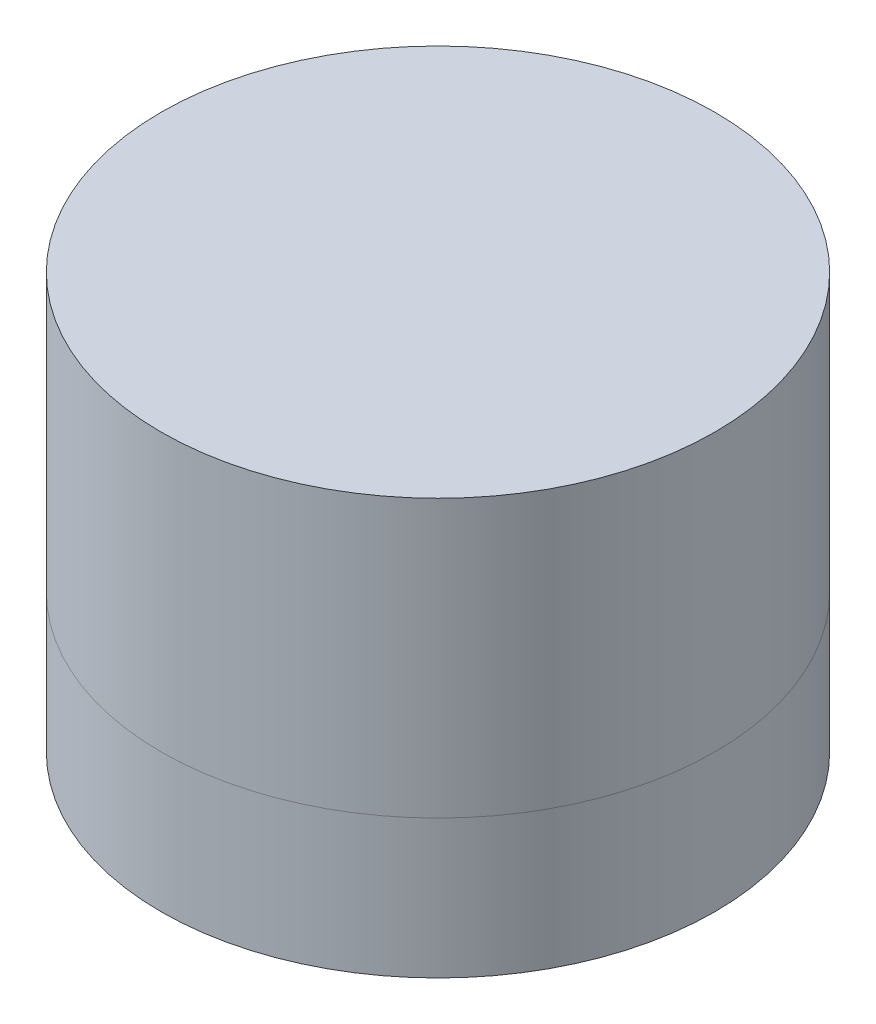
ISO-10303-21;
HEADER;
FILE_DESCRIPTION(('STEP AP214'),'2;1');
FILE_NAME('part.step','',(''),(''),'','','');
FILE_SCHEMA(('AUTOMOTIVE_DESIGN { 1 0 10303 214 1 1 1 1 }'));
ENDSEC;
DATA;
#1=APPLICATION_CONTEXT('core data for automotive mechanical design processes');
#2=APPLICATION_PROTOCOL_DEFINITION('international standard','automotive_design',2000,#1);
#3=PRODUCT_CONTEXT('',#1,'mechanical');
#4=PRODUCT('Part','Part','',(#3));
#5=PRODUCT_RELATED_PRODUCT_CATEGORY('part','',(#4));
#6=PRODUCT_DEFINITION_FORMATION('','',#4);
#7=PRODUCT_DEFINITION_CONTEXT('part definition',#1,'design');
#8=PRODUCT_DEFINITION('design','',#6,#7);
#9=PRODUCT_DEFINITION_SHAPE('','',#8);
#10=(LENGTH_UNIT() NAMED_UNIT(*) SI_UNIT(.MILLI.,.METRE.));
#11=(NAMED_UNIT(*) PLANE_ANGLE_UNIT() SI_UNIT($,.RADIAN.));
#12=(NAMED_UNIT(*) SI_UNIT($,.STERADIAN.) SOLID_ANGLE_UNIT());
#13=UNCERTAINTY_MEASURE_WITH_UNIT(LENGTH_MEASURE(1.E-05),#10,'distance_accuracy_value','');
#14=(GEOMETRIC_REPRESENTATION_CONTEXT(3) GLOBAL_UNCERTAINTY_ASSIGNED_CONTEXT((#13)) GLOBAL_UNIT_ASSIGNED_CONTEXT((#10,
#11,#12)) REPRESENTATION_CONTEXT('',''));
#15=CARTESIAN_POINT('',(0.,0.,0.));
#16=DIRECTION('',(0.,0.,1.));
#17=DIRECTION('',(1.,0.,0.));
#18=AXIS2_PLACEMENT_3D('',#15,#16,#17);
#19=CARTESIAN_POINT('',(4.8278025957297,-10.,0.));
#20=DIRECTION('',(0.,1.,0.));
#21=DIRECTION('',(0.,0.,1.));
#22=AXIS2_PLACEMENT_3D('',#19,#20,#21);
#23=PLANE('',#22);
#24=CARTESIAN_POINT('',(4.8278025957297,-10.,0.));
#25=DIRECTION('',(0.,1.,0.));
#26=DIRECTION('',(0.,0.,1.));
#27=AXIS2_PLACEMENT_3D('',#24,#25,#26);
#28=CIRCLE('',#27,20.);
#29=CARTESIAN_POINT('',(4.8278025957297,-10.,20.));
#30=VERTEX_POINT('',#29);
#31=EDGE_CURVE('E111',#30,#30,#28,.T.);
#32=ORIENTED_EDGE('',*,*,#31,.F.);
#33=EDGE_LOOP('',(#32));
#34=FACE_BOUND('',#33,.T.);
#35=ADVANCED_FACE('F74',(#34),#23,.F.);
#36=CARTESIAN_POINT('',(4.8278025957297,-10.,0.));
#37=DIRECTION('',(0.,1.,0.));
#38=DIRECTION('',(0.,0.,1.));
#39=AXIS2_PLACEMENT_3D('',#36,#37,#38);
#40=CYLINDRICAL_SURFACE('',#39,20.);
#41=ORIENTED_EDGE('',*,*,#31,.T.);
#42=EDGE_LOOP('',(#41));
#43=FACE_BOUND('',#42,.T.);
#44=CARTESIAN_POINT('',(4.8278025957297,0.,0.));
#45=DIRECTION('',(0.,1.,0.));
#46=DIRECTION('',(0.,0.,1.));
#47=AXIS2_PLACEMENT_3D('',#44,#45,#46);
#48=CIRCLE('',#47,20.);
#49=CARTESIAN_POINT('',(4.8278025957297,0.,20.));
#50=VERTEX_POINT('',#49);
#51=EDGE_CURVE('E78',#50,#50,#48,.F.);
#52=ORIENTED_EDGE('',*,*,#51,.T.);
#53=EDGE_LOOP('',(#52));
#54=FACE_BOUND('',#53,.T.);
#55=ADVANCED_FACE('F76',(#43,#54),#40,.T.);
#56=CARTESIAN_POINT('',(4.8278025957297,-0.450000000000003,0.));
#57=DIRECTION('',(0.,-1.,0.));
#58=DIRECTION('',(-1.,0.,0.));
#59=AXIS2_PLACEMENT_3D('',#56,#57,#58);
#60=SPHERICAL_SURFACE('',#59,10.58);
#61=CARTESIAN_POINT('',(4.8278025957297,3.,0.));
#62=DIRECTION('',(0.,-1.,0.));
#63=DIRECTION('',(0.,0.,-1.));
#64=AXIS2_PLACEMENT_3D('',#61,#62,#63);
#65=CIRCLE('',#64,10.0016948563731);
#66=CARTESIAN_POINT('',(4.8278025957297,3.,-10.0016948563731));
#67=VERTEX_POINT('',#66);
#68=EDGE_CURVE('E113',#67,#67,#65,.T.);
#69=ORIENTED_EDGE('',*,*,#68,.F.);
#70=EDGE_LOOP('',(#69));
#71=FACE_BOUND('',#70,.T.);
#72=ADVANCED_FACE('F107',(#71),#60,.T.);
#73=CARTESIAN_POINT('',(4.8278025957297,3.,0.));
#74=DIRECTION('',(0.,1.,0.));
#75=DIRECTION('',(0.,0.,1.));
#76=AXIS2_PLACEMENT_3D('',#73,#74,#75);
#77=CONICAL_SURFACE('',#76,10.0016948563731,0.000564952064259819);
#78=CARTESIAN_POINT('',(4.8278025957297,0.,0.));
#79=DIRECTION('',(0.,-1.,0.));
#80=DIRECTION('',(0.,0.,-1.));
#81=AXIS2_PLACEMENT_3D('',#78,#79,#80);
#82=CIRCLE('',#81,10.);
#83=CARTESIAN_POINT('',(4.8278025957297,0.,-10.));
#84=VERTEX_POINT('',#83);
#85=EDGE_CURVE('E83',#84,#84,#82,.T.);
#86=ORIENTED_EDGE('',*,*,#85,.F.);
#87=EDGE_LOOP('',(#86));
#88=FACE_BOUND('',#87,.T.);
#89=ORIENTED_EDGE('',*,*,#68,.T.);
#90=EDGE_LOOP('',(#89));
#91=FACE_BOUND('',#90,.T.);
#92=ADVANCED_FACE('F98',(#88,#91),#77,.T.);
#93=CARTESIAN_POINT('',(14.8278025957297,0.,0.));
#94=DIRECTION('',(0.,-1.,0.));
#95=DIRECTION('',(0.,0.,-1.));
#96=AXIS2_PLACEMENT_3D('',#93,#94,#95);
#97=PLANE('',#96);
#98=CARTESIAN_POINT('',(4.8278025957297,0.,-15.));
#99=CARTESIAN_POINT('',(5.07532465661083,0.,-15.0000190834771));
#100=CARTESIAN_POINT('',(5.32285951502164,0.,-14.9941059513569));
#101=CARTESIAN_POINT('',(5.81556402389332,0.,-14.9702985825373));
#102=CARTESIAN_POINT('',(6.06073787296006,0.,-14.9524909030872));
#103=CARTESIAN_POINT('',(6.54872354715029,0.,-14.9048990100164));
#104=CARTESIAN_POINT('',(6.79154106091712,0.,-14.8751733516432));
#105=CARTESIAN_POINT('',(7.27481111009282,0.,-14.8037804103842));
#106=CARTESIAN_POINT('',(7.51526796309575,0.,-14.7621423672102));
#107=CARTESIAN_POINT('',(7.99381910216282,0.,-14.6669527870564));
#108=CARTESIAN_POINT('',(8.23191332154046,0.,-14.6134009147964));
#109=CARTESIAN_POINT('',(8.70574394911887,0.,-14.4944140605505));
#110=CARTESIAN_POINT('',(8.94147298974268,0.,-14.4289497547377));
#111=CARTESIAN_POINT('',(9.41058131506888,0.,-14.286166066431));
#112=CARTESIAN_POINT('',(9.64394327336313,0.,-14.2087897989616));
#113=CARTESIAN_POINT('',(10.1083271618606,0.,-14.042212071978));
#114=CARTESIAN_POINT('',(10.3393195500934,0.,-13.9529283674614));
#115=CARTESIAN_POINT('',(10.7967237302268,0.,-13.7634844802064));
#116=CARTESIAN_POINT('',(11.0231368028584,0.,-13.6633273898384));
#117=CARTESIAN_POINT('',(11.4691967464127,0.,-13.4528238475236));
#118=CARTESIAN_POINT('',(11.6888805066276,0.,-13.3425556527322));
#119=CARTESIAN_POINT('',(12.121487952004,0.,-13.1118590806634));
#120=CARTESIAN_POINT('',(12.3344391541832,0.,-12.9914823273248));
#121=CARTESIAN_POINT('',(12.7535917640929,0.,-12.7405951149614));
#122=CARTESIAN_POINT('',(12.9598081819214,0.,-12.6101097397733));
#123=CARTESIAN_POINT('',(13.3655043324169,0.,-12.3390321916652));
#124=CARTESIAN_POINT('',(13.5649836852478,0.,-12.1984394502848));
#125=CARTESIAN_POINT('',(13.9572217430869,0.,-11.90717295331));
#126=CARTESIAN_POINT('',(14.1499622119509,0.,-11.7564746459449));
#127=CARTESIAN_POINT('',(14.5287406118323,0.,-11.4450198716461));
#128=CARTESIAN_POINT('',(14.7147405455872,0.,-11.2842172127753));
#129=CARTESIAN_POINT('',(15.0800586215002,0.,-10.9525778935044));
#130=CARTESIAN_POINT('',(15.2593177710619,0.,-10.7816763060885));
#131=CARTESIAN_POINT('',(15.6094238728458,0.,-10.4315941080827));
#132=CARTESIAN_POINT('',(15.7802740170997,0.,-10.2524166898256));
#133=CARTESIAN_POINT('',(16.1118235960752,0.,-9.88723717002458));
#134=CARTESIAN_POINT('',(16.2725870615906,0.,-9.70129325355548));
#135=CARTESIAN_POINT('',(16.5839804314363,0.,-9.32260567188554));
#136=CARTESIAN_POINT('',(16.7346555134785,0.,-9.12989917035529));
#137=CARTESIAN_POINT('',(17.0258916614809,0.,-8.73770686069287));
#138=CARTESIAN_POINT('',(17.1664761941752,0.,-8.53823848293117));
#139=CARTESIAN_POINT('',(17.4375536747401,0.,-8.13254228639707));
#140=CARTESIAN_POINT('',(17.5680460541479,0.,-7.92631408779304));
#141=CARTESIAN_POINT('',(17.8189639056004,0.,-7.50711592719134));
#142=CARTESIAN_POINT('',(17.9393631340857,0.,-7.29413026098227));
#143=CARTESIAN_POINT('',(18.1701201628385,0.,-6.86143135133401));
#144=CARTESIAN_POINT('',(18.2804251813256,0.,-6.64168997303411));
#145=CARTESIAN_POINT('',(18.4910222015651,0.,-6.19549401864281));
#146=CARTESIAN_POINT('',(18.5912348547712,0.,-5.96900203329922));
#147=CARTESIAN_POINT('',(18.7807200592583,0.,-5.51158845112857));
#148=CARTESIAN_POINT('',(18.869996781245,0.,-5.28066858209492));
#149=CARTESIAN_POINT('',(19.0365604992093,0.,-4.81640816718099));
#150=CARTESIAN_POINT('',(19.113928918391,0.,-4.58309687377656));
#151=CARTESIAN_POINT('',(19.2567014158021,0.,-4.11407008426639));
#152=CARTESIAN_POINT('',(19.3221614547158,0.,-3.87837163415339));
#153=CARTESIAN_POINT('',(19.4411430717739,0.,-3.40458193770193));
#154=CARTESIAN_POINT('',(19.4946930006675,0.,-3.16649781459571));
#155=CARTESIAN_POINT('',(19.589882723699,0.,-2.68794654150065));
#156=CARTESIAN_POINT('',(19.6315218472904,0.,-2.44747925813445));
#157=CARTESIAN_POINT('',(19.7029195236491,0.,-1.9641685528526));
#158=CARTESIAN_POINT('',(19.7326478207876,0.,-1.72132066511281));
#159=CARTESIAN_POINT('',(19.7802528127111,0.,-1.23325210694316));
#160=CARTESIAN_POINT('',(19.7980699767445,0.,-0.988025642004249));
#161=CARTESIAN_POINT('',(19.8218844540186,0.,-0.495202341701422));
#162=CARTESIAN_POINT('',(19.8277941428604,0.,-0.247601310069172));
#163=CARTESIAN_POINT('',(19.8278110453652,0.,0.247506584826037));
#164=CARTESIAN_POINT('',(19.8219227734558,0.,0.495013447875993));
#165=CARTESIAN_POINT('',(19.7981428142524,0.,0.98767531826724));
#166=CARTESIAN_POINT('',(19.7803375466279,0.,1.23283445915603));
#167=CARTESIAN_POINT('',(19.7327533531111,0.,1.72079537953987));
#168=CARTESIAN_POINT('',(19.7030326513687,0.,1.96360282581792));
#169=CARTESIAN_POINT('',(19.6316458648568,0.,2.44685972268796));
#170=CARTESIAN_POINT('',(19.5900086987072,0.,2.68731344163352));
#171=CARTESIAN_POINT('',(19.4948188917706,0.,3.16586469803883));
#172=CARTESIAN_POINT('',(19.4412655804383,0.,3.40396210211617));
#173=CARTESIAN_POINT('',(19.3222734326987,0.,3.87780567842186));
#174=CARTESIAN_POINT('',(19.2568049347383,0.,4.11354439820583));
#175=CARTESIAN_POINT('',(19.1140104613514,0.,4.58267859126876));
#176=CARTESIAN_POINT('',(19.0366272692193,0.,4.81605663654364));
#177=CARTESIAN_POINT('',(18.8700336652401,0.,5.28047940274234));
#178=CARTESIAN_POINT('',(18.7807406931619,0.,5.51149446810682));
#179=CARTESIAN_POINT('',(18.5912867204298,0.,5.96892098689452));
#180=CARTESIAN_POINT('',(18.4911298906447,0.,6.19533416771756));
#181=CARTESIAN_POINT('',(18.2806265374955,0.,6.64139418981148));
#182=CARTESIAN_POINT('',(18.1703582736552,0.,6.86107792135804));
#183=CARTESIAN_POINT('',(17.9396616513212,0.,7.29368534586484));
#184=CARTESIAN_POINT('',(17.8192849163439,0.,7.50663655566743));
#185=CARTESIAN_POINT('',(17.5683977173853,0.,7.92578917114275));
#186=CARTESIAN_POINT('',(17.4379123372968,0.,8.13200558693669));
#187=CARTESIAN_POINT('',(17.1668347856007,0.,8.53770173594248));
#188=CARTESIAN_POINT('',(17.026242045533,0.,8.7371810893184));
#189=CARTESIAN_POINT('',(16.7349755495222,0.,9.12941914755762));
#190=CARTESIAN_POINT('',(16.5842772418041,0.,9.32215961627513));
#191=CARTESIAN_POINT('',(16.2728224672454,0.,9.70093801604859));
#192=CARTESIAN_POINT('',(16.1120198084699,0.,9.88693794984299));
#193=CARTESIAN_POINT('',(15.7803804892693,0.,10.2522560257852));
#194=CARTESIAN_POINT('',(15.6094789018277,0.,10.4315151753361));
#195=CARTESIAN_POINT('',(15.2593967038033,0.,10.7816212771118));
#196=CARTESIAN_POINT('',(15.0802192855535,0.,10.9524714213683));
#197=CARTESIAN_POINT('',(14.7150397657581,0.,11.2840210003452));
#198=CARTESIAN_POINT('',(14.5290958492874,0.,11.4447844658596));
#199=CARTESIAN_POINT('',(14.1504082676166,0.,11.7561778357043));
#200=CARTESIAN_POINT('',(13.957701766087,0.,11.9068529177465));
#201=CARTESIAN_POINT('',(13.5655094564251,0.,12.1980890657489));
#202=CARTESIAN_POINT('',(13.3660410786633,0.,12.3386735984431));
#203=CARTESIAN_POINT('',(12.9603448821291,0.,12.609751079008));
#204=CARTESIAN_POINT('',(12.7541166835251,0.,12.7402434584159));
#205=CARTESIAN_POINT('',(12.3349185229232,0.,12.9911613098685));
#206=CARTESIAN_POINT('',(12.121932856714,0.,13.111560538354));
#207=CARTESIAN_POINT('',(11.6892339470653,0.,13.3423175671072));
#208=CARTESIAN_POINT('',(11.4694925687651,0.,13.4526225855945));
#209=CARTESIAN_POINT('',(11.0232966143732,0.,13.6632196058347));
#210=CARTESIAN_POINT('',(10.7968046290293,0.,13.7634322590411));
#211=CARTESIAN_POINT('',(10.3393910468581,0.,13.9529174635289));
#212=CARTESIAN_POINT('',(10.1084711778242,0.,14.0421941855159));
#213=CARTESIAN_POINT('',(9.64421076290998,0.,14.2087579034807));
#214=CARTESIAN_POINT('',(9.41089946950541,0.,14.2861263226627));
#215=CARTESIAN_POINT('',(8.94187267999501,0.,14.4288988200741));
#216=CARTESIAN_POINT('',(8.70617422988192,0.,14.4943588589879));
#217=CARTESIAN_POINT('',(8.23238453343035,0.,14.6133404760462));
#218=CARTESIAN_POINT('',(7.9943004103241,0.,14.6668904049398));
#219=CARTESIAN_POINT('',(7.51574913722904,0.,14.7620801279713));
#220=CARTESIAN_POINT('',(7.27528185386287,0.,14.8037192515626));
#221=CARTESIAN_POINT('',(6.79197114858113,0.,14.8751169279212));
#222=CARTESIAN_POINT('',(6.54912326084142,0.,14.9048452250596));
#223=CARTESIAN_POINT('',(6.06105470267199,0.,14.9524502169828));
#224=CARTESIAN_POINT('',(5.81582823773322,0.,14.9702673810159));
#225=CARTESIAN_POINT('',(5.32300493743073,0.,14.9940818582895));
#226=CARTESIAN_POINT('',(5.07540390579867,0.,14.999991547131));
#227=CARTESIAN_POINT('',(4.58029601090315,0.,15.0000084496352));
#228=CARTESIAN_POINT('',(4.33278914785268,0.,14.9941201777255));
#229=CARTESIAN_POINT('',(3.84012727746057,0.,14.9703402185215));
#230=CARTESIAN_POINT('',(3.59496813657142,0.,14.9525349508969));
#231=CARTESIAN_POINT('',(3.10700721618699,0.,14.9049507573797));
#232=CARTESIAN_POINT('',(2.86419976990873,0.,14.8752300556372));
#233=CARTESIAN_POINT('',(2.3809428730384,0.,14.8038432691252));
#234=CARTESIAN_POINT('',(2.14048915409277,0.,14.7622061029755));
#235=CARTESIAN_POINT('',(1.66193789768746,0.,14.667016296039));
#236=CARTESIAN_POINT('',(1.42384049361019,0.,14.6134629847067));
#237=CARTESIAN_POINT('',(0.949996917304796,0.,14.4944708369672));
#238=CARTESIAN_POINT('',(0.714258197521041,0.,14.4290023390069));
#239=CARTESIAN_POINT('',(0.2451240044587,0.,14.2862078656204));
#240=CARTESIAN_POINT('',(0.0117459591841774,0.,14.2088246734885));
#241=CARTESIAN_POINT('',(-0.452676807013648,0.,14.0422310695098));
#242=CARTESIAN_POINT('',(-0.68369187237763,0.,13.9529380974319));
#243=CARTESIAN_POINT('',(-1.14111839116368,0.,13.7634841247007));
#244=CARTESIAN_POINT('',(-1.36753157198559,0.,13.6633272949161));
#245=CARTESIAN_POINT('',(-1.81359159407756,0.,13.4528239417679));
#246=CARTESIAN_POINT('',(-2.03327532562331,0.,13.342555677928));
#247=CARTESIAN_POINT('',(-2.46588275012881,0.,13.1118590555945));
#248=CARTESIAN_POINT('',(-2.67883395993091,0.,12.9914823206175));
#249=CARTESIAN_POINT('',(-3.09798657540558,0.,12.7405951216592));
#250=CARTESIAN_POINT('',(-3.30420299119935,0.,12.6101097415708));
#251=CARTESIAN_POINT('',(-3.70989914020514,0.,12.3390321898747));
#252=CARTESIAN_POINT('',(-3.90937849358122,0.,12.1984394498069));
#253=CARTESIAN_POINT('',(-4.30161655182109,0.,11.9071729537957));
#254=CARTESIAN_POINT('',(-4.49435702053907,0.,11.7564746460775));
#255=CARTESIAN_POINT('',(-4.87313542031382,0.,11.4450198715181));
#256=CARTESIAN_POINT('',(-5.05913535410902,0.,11.2842172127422));
#257=CARTESIAN_POINT('',(-5.42445343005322,0.,10.9525778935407));
#258=CARTESIAN_POINT('',(-5.6037125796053,0.,10.7816763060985));
#259=CARTESIAN_POINT('',(-5.9538186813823,0.,10.431594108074));
#260=CARTESIAN_POINT('',(-6.12466882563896,0.,10.2524166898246));
#261=CARTESIAN_POINT('',(-6.45621840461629,0.,9.88723717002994));
#262=CARTESIAN_POINT('',(-6.6169818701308,0.,9.70129325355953));
#263=CARTESIAN_POINT('',(-6.92837523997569,0.,9.32260567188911));
#264=CARTESIAN_POINT('',(-7.079050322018,0.,9.12989917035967));
#265=CARTESIAN_POINT('',(-7.37028647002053,0.,8.73770686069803));
#266=CARTESIAN_POINT('',(-7.51087100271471,0.,8.5382384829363));
#267=CARTESIAN_POINT('',(-7.7819484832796,0.,8.13254228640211));
#268=CARTESIAN_POINT('',(-7.91244086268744,0.,7.926314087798));
#269=CARTESIAN_POINT('',(-8.16335871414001,0.,7.5071159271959));
#270=CARTESIAN_POINT('',(-8.28375794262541,0.,7.29413026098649));
#271=CARTESIAN_POINT('',(-8.51451497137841,0.,6.86143135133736));
#272=CARTESIAN_POINT('',(-8.62481998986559,0.,6.64168997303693));
#273=CARTESIAN_POINT('',(-8.83541701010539,0.,6.19549401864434));
#274=CARTESIAN_POINT('',(-8.93562966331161,0.,5.96900203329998));
#275=CARTESIAN_POINT('',(-9.12511486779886,0.,5.51158845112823));
#276=CARTESIAN_POINT('',(-9.21439158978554,0.,5.28066858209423));
#277=CARTESIAN_POINT('',(-9.3809553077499,0.,4.81640816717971));
#278=CARTESIAN_POINT('',(-9.45832372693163,0.,4.58309687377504));
#279=CARTESIAN_POINT('',(-9.6010962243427,0.,4.11407008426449));
#280=CARTESIAN_POINT('',(-9.66655626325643,0.,3.87837163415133));
#281=CARTESIAN_POINT('',(-9.78553788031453,0.,3.40458193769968));
#282=CARTESIAN_POINT('',(-9.83908780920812,0.,3.16649781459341));
#283=CARTESIAN_POINT('',(-9.93427753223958,0.,2.68794654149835));
#284=CARTESIAN_POINT('',(-9.97591665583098,0.,2.4474792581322));
#285=CARTESIAN_POINT('',(-10.0473143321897,0.,1.96416855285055));
#286=CARTESIAN_POINT('',(-10.0770426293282,0.,1.72132066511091));
#287=CARTESIAN_POINT('',(-10.1246476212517,0.,1.23325210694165));
#288=CARTESIAN_POINT('',(-10.1424647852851,0.,0.988025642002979));
#289=CARTESIAN_POINT('',(-10.1662792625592,0.,0.495202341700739));
#290=CARTESIAN_POINT('',(-10.172188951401,0.,0.247601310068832));
#291=CARTESIAN_POINT('',(-10.1722058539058,0.,-0.247506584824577));
#292=CARTESIAN_POINT('',(-10.1663175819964,0.,-0.495013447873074));
#293=CARTESIAN_POINT('',(-10.142537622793,0.,-0.987675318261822));
#294=CARTESIAN_POINT('',(-10.1247323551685,0.,-1.23283445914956));
#295=CARTESIAN_POINT('',(-10.0771481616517,0.,-1.72079537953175));
#296=CARTESIAN_POINT('',(-10.0474274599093,0.,-1.96360282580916));
#297=CARTESIAN_POINT('',(-9.97604067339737,0.,-2.44685972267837));
#298=CARTESIAN_POINT('',(-9.93440350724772,0.,-2.68731344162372));
#299=CARTESIAN_POINT('',(-9.83921370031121,0.,-3.16586469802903));
#300=CARTESIAN_POINT('',(-9.78566038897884,0.,-3.40396210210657));
#301=CARTESIAN_POINT('',(-9.66666824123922,0.,-3.87780567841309));
#302=CARTESIAN_POINT('',(-9.6011997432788,0.,-4.11354439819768));
#303=CARTESIAN_POINT('',(-9.45840526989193,0.,-4.58267859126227));
#304=CARTESIAN_POINT('',(-9.38102207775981,0.,-4.81605663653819));
#305=CARTESIAN_POINT('',(-9.21442847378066,0.,-5.2804794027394));
#306=CARTESIAN_POINT('',(-9.12513550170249,0.,-5.51149446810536));
#307=CARTESIAN_POINT('',(-8.93568152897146,0.,-5.96892098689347));
#308=CARTESIAN_POINT('',(-8.83552469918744,0.,-6.19533416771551));
#309=CARTESIAN_POINT('',(-8.62502134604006,0.,-6.64139418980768));
#310=CARTESIAN_POINT('',(-8.51475308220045,0.,-6.8610779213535));
#311=CARTESIAN_POINT('',(-8.28405645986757,0.,-7.29368534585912));
#312=CARTESIAN_POINT('',(-8.16367972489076,0.,-7.50663655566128));
#313=CARTESIAN_POINT('',(-7.91279252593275,0.,-7.92578917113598));
#314=CARTESIAN_POINT('',(-7.78230714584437,0.,-8.13200558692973));
#315=CARTESIAN_POINT('',(-7.51122959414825,0.,-8.53770173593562));
#316=CARTESIAN_POINT('',(-7.37063685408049,0.,-8.73718108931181));
#317=CARTESIAN_POINT('',(-7.07937035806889,0.,-9.12941914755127));
#318=CARTESIAN_POINT('',(-6.92867205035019,0.,-9.32215961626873));
#319=CARTESIAN_POINT('',(-6.61721727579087,0.,-9.7009380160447));
#320=CARTESIAN_POINT('',(-6.4564146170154,0.,-9.88693794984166));
#321=CARTESIAN_POINT('',(-6.12477529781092,0.,-10.2522560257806));
#322=CARTESIAN_POINT('',(-5.95387371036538,0.,-10.4315151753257));
#323=CARTESIAN_POINT('',(-5.60379151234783,0.,-10.7816212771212));
#324=CARTESIAN_POINT('',(-5.4246140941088,0.,-10.9524714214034));
#325=CARTESIAN_POINT('',(-5.05943457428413,0.,-11.2840210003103));
#326=CARTESIAN_POINT('',(-4.87349065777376,0.,-11.4447844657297));
#327=CARTESIAN_POINT('',(-4.49480307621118,0.,-11.7561778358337));
#328=CARTESIAN_POINT('',(-4.30209657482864,0.,-11.9068529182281));
#329=CARTESIAN_POINT('',(-3.9099042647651,0.,-12.1980890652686));
#330=CARTESIAN_POINT('',(-3.71043588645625,0.,-12.3386735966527));
#331=CARTESIAN_POINT('',(-3.30473969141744,0.,-12.6097510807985));
#332=CARTESIAN_POINT('',(-3.09851149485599,0.,-12.7402434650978));
#333=CARTESIAN_POINT('',(-2.67931332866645,0.,-12.9911613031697));
#334=CARTESIAN_POINT('',(-2.46632765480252,0.,-13.1115605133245));
#335=CARTESIAN_POINT('',(-2.0336287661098,0.,-13.3423175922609));
#336=CARTESIAN_POINT('',(-1.81388741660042,0.,-13.4526226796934));
#337=CARTESIAN_POINT('',(-1.36769138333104,0.,-13.6632195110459));
#338=CARTESIAN_POINT('',(-1.14119928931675,0.,-13.7634319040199));
#339=CARTESIAN_POINT('',(-0.683763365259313,0.,-13.9529271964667));
#340=CARTESIAN_POINT('',(-0.452820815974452,0.,-14.0422131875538));
#341=CARTESIAN_POINT('',(0.0114784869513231,0.,-14.2087927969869));
#342=CARTESIAN_POINT('',(0.244805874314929,0.,-14.2861681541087));
#343=CARTESIAN_POINT('',(0.713858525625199,0.,-14.4289514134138));
#344=CARTESIAN_POINT('',(0.949566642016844,0.,-14.4944156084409));
#345=CARTESIAN_POINT('',(1.42336932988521,0.,-14.6134026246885));
#346=CARTESIAN_POINT('',(1.66145669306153,0.,-14.6669541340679));
#347=CARTESIAN_POINT('',(2.14000793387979,0.,-14.7621436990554));
#348=CARTESIAN_POINT('',(2.38047187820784,0.,-14.8037814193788));
#349=CARTESIAN_POINT('',(2.86376998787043,0.,-14.875174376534));
#350=CARTESIAN_POINT('',(3.10660857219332,0.,-14.9048996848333));
#351=CARTESIAN_POINT('',(3.59465027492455,0.,-14.9524915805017));
#352=CARTESIAN_POINT('',(3.83985914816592,0.,-14.9702989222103));
#353=CARTESIAN_POINT('',(4.33264769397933,0.,-14.9941062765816));
#354=CARTESIAN_POINT('',(4.58023159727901,0.,-15.0000190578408));
#355=CARTESIAN_POINT('',(4.8278025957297,0.,-15.));
#356=B_SPLINE_CURVE_WITH_KNOTS('',3,(#98,#99,#100,#101,#102,#103,#104,#105,#106,#107,#108,#109,
#110,#111,#112,#113,#114,#115,#116,#117,#118,#119,#120,#121,#122,#123,#124,#125,#126,#127,#128,
#129,#130,#131,#132,#133,#134,#135,#136,#137,#138,#139,#140,#141,#142,#143,#144,#145,#146,#147,
#148,#149,#150,#151,#152,#153,#154,#155,#156,#157,#158,#159,#160,#161,#162,#163,#164,#165,#166,
#167,#168,#169,#170,#171,#172,#173,#174,#175,#176,#177,#178,#179,#180,#181,#182,#183,#184,#185,
#186,#187,#188,#189,#190,#191,#192,#193,#194,#195,#196,#197,#198,#199,#200,#201,#202,#203,#204,
#205,#206,#207,#208,#209,#210,#211,#212,#213,#214,#215,#216,#217,#218,#219,#220,#221,#222,#223,
#224,#225,#226,#227,#228,#229,#230,#231,#232,#233,#234,#235,#236,#237,#238,#239,#240,#241,#242,
#243,#244,#245,#246,#247,#248,#249,#250,#251,#252,#253,#254,#255,#256,#257,#258,#259,#260,#261,
#262,#263,#264,#265,#266,#267,#268,#269,#270,#271,#272,#273,#274,#275,#276,#277,#278,#279,#280,
#281,#282,#283,#284,#285,#286,#287,#288,#289,#290,#291,#292,#293,#294,#295,#296,#297,#298,#299,
#300,#301,#302,#303,#304,#305,#306,#307,#308,#309,#310,#311,#312,#313,#314,#315,#316,#317,#318,
#319,#320,#321,#322,#323,#324,#325,#326,#327,#328,#329,#330,#331,#332,#333,#334,#335,#336,#337,
#338,#339,#340,#341,#342,#343,#344,#345,#346,#347,#348,#349,#350,#351,#352,#353,#354,#355),
.UNSPECIFIED.,.F.,.F.,(4,2,2,2,2,2,2,2,2,2,2,2,2,2,2,2,2,2,2,2,2,2,2,2,2,2,2,2,2,2,2,2,2,2,2,2,
2,2,2,2,2,2,2,2,2,2,2,2,2,2,2,2,2,2,2,2,2,2,2,2,2,2,2,2,2,2,2,2,2,2,2,2,2,2,2,2,2,2,2,2,2,2,2,2,
2,2,2,2,2,2,2,2,2,2,2,2,2,2,2,2,2,2,2,2,2,2,2,2,2,2,2,2,2,2,2,2,2,2,2,2,2,2,2,2,2,2,2,2,4),(0.,
0.742513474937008,1.47968166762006,2.21327155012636,2.94507601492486,3.67690107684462,
4.4105525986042,5.14782302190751,5.8904785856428,6.63292349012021,7.37004184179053,
8.10360136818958,8.8353955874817,9.56723099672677,10.3009137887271,11.038236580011,
11.7809656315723,12.5234105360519,13.2605288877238,13.9940884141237,14.7258826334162,
15.4577180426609,16.1914008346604,16.9287236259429,17.6714526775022,18.4138975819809,
19.1510159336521,19.8845754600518,20.6163696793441,21.3482050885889,22.0818878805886,
22.8192106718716,23.5619397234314,24.3043846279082,25.0415029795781,25.7750625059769,
26.5068567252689,27.2386921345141,27.9723749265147,28.7096977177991,29.4524267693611,
30.1948716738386,30.931990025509,31.6655495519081,32.3973437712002,33.1291791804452,
33.8628619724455,34.6001847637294,35.3429138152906,36.0853587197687,36.8224770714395,
37.5560365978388,38.287830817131,39.019666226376,39.753349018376,40.4906718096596,
41.2334008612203,41.9758457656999,42.7129641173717,43.4465236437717,44.1783178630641,
44.9101532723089,45.6438360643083,46.3811588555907,47.1238879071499,47.8663328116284,
48.6034511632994,49.3370106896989,50.0688049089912,50.8006403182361,51.5343231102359,
52.2716459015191,53.0143749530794,53.7568198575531,54.4939382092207,55.2274977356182,
55.9592919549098,56.6911273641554,57.4248101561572,58.1621329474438,58.9048619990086,
59.6473069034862,60.3844252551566,61.1179847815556,61.8497790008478,62.5816144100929,
63.3152972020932,64.0526199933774,64.795349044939,65.5377939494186,66.2749123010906,
67.0084718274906,67.7402660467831,68.4721014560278,69.205784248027,69.9431070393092,
70.685836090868,71.4282809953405,72.1653993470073,72.8989588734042,73.6307530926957,
74.3625885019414,75.0962712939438,75.8335940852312,76.5763231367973,77.3187680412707,
78.0558863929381,78.7894459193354,79.5212401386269,80.2530755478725,80.9867583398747,
81.7240811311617,82.4668101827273,83.2092550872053,83.9463734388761,84.6799329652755,
85.4117271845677,86.1435625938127,86.8772453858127,87.6145681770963,88.357297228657,
89.0998156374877,89.8369863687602,90.5705771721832,91.3023817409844,92.0342069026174,
92.7678593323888,93.5051322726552,94.2477927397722),.UNSPECIFIED.);
#357=CARTESIAN_POINT('',(4.8278025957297,0.,-15.));
#358=VERTEX_POINT('',#357);
#359=EDGE_CURVE('E13',#358,#358,#356,.T.);
#360=ORIENTED_EDGE('',*,*,#359,.F.);
#361=EDGE_LOOP('',(#360));
#362=FACE_BOUND('',#361,.T.);
#363=ORIENTED_EDGE('',*,*,#85,.T.);
#364=EDGE_LOOP('',(#363));
#365=FACE_BOUND('',#364,.T.);
#366=ADVANCED_FACE('F87',(#362,#365),#97,.F.);
#367=CARTESIAN_POINT('',(4.51562772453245,0.,-15.0000002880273));
#368=DIRECTION('',(0.,1.,0.));
#369=DIRECTION('',(0.999999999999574,0.,9.22647382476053E-07));
#370=AXIS2_PLACEMENT_3D('',#367,#368,#369);
#371=PLANE('',#370);
#372=ORIENTED_EDGE('',*,*,#51,.F.);
#373=EDGE_LOOP('',(#372));
#374=FACE_BOUND('',#373,.T.);
#375=ORIENTED_EDGE('',*,*,#359,.T.);
#376=EDGE_LOOP('',(#375));
#377=FACE_BOUND('',#376,.T.);
#378=ADVANCED_FACE('F90',(#374,#377),#371,.T.);
#379=CLOSED_SHELL('',(#35,#55,#72,#92,#366,#378));
#380=MANIFOLD_SOLID_BREP('B2',#379);
#381=CARTESIAN_POINT('',(4.8278025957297,-10.,0.));
#382=DIRECTION('',(0.,1.,0.));
#383=DIRECTION('',(0.,0.,1.));
#384=AXIS2_PLACEMENT_3D('',#381,#382,#383);
#385=CYLINDRICAL_SURFACE('',#384,20.);
#386=CARTESIAN_POINT('',(4.8278025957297,0.,0.));
#387=DIRECTION('',(0.,1.,0.));
#388=DIRECTION('',(0.,0.,1.));
#389=AXIS2_PLACEMENT_3D('',#386,#387,#388);
#390=CIRCLE('',#389,20.);
#391=CARTESIAN_POINT('',(4.8278025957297,0.,20.));
#392=VERTEX_POINT('',#391);
#393=EDGE_CURVE('E206',#392,#392,#390,.F.);
#394=ORIENTED_EDGE('',*,*,#393,.F.);
#395=EDGE_LOOP('',(#394));
#396=FACE_BOUND('',#395,.T.);
#397=CARTESIAN_POINT('',(4.8278025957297,20.,0.));
#398=DIRECTION('',(0.,1.,0.));
#399=DIRECTION('',(0.,0.,1.));
#400=AXIS2_PLACEMENT_3D('',#397,#398,#399);
#401=CIRCLE('',#400,20.);
#402=CARTESIAN_POINT('',(4.8278025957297,20.,20.));
#403=VERTEX_POINT('',#402);
#404=EDGE_CURVE('E242',#403,#403,#401,.T.);
#405=ORIENTED_EDGE('',*,*,#404,.F.);
#406=EDGE_LOOP('',(#405));
#407=FACE_BOUND('',#406,.T.);
#408=ADVANCED_FACE('F203',(#396,#407),#385,.T.);
#409=CARTESIAN_POINT('',(4.8278025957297,20.,0.));
#410=DIRECTION('',(0.,1.,0.));
#411=DIRECTION('',(0.,0.,1.));
#412=AXIS2_PLACEMENT_3D('',#409,#410,#411);
#413=PLANE('',#412);
#414=ORIENTED_EDGE('',*,*,#404,.T.);
#415=EDGE_LOOP('',(#414));
#416=FACE_BOUND('',#415,.T.);
#417=ADVANCED_FACE('F231',(#416),#413,.T.);
#418=CARTESIAN_POINT('',(4.8278025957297,-0.450000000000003,0.));
#419=DIRECTION('',(0.,-1.,0.));
#420=DIRECTION('',(1.,0.,0.));
#421=AXIS2_PLACEMENT_3D('',#418,#419,#420);
#422=SPHERICAL_SURFACE('',#421,13.45);
#423=CARTESIAN_POINT('',(4.8278025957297,3.,0.));
#424=DIRECTION('',(0.,-1.,0.));
#425=DIRECTION('',(0.,0.,-1.));
#426=AXIS2_PLACEMENT_3D('',#423,#424,#425);
#427=CIRCLE('',#426,13.);
#428=CARTESIAN_POINT('',(4.8278025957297,3.,-13.));
#429=VERTEX_POINT('',#428);
#430=EDGE_CURVE('E243',#429,#429,#427,.T.);
#431=ORIENTED_EDGE('',*,*,#430,.T.);
#432=EDGE_LOOP('',(#431));
#433=FACE_BOUND('',#432,.T.);
#434=ADVANCED_FACE('F236',(#433),#422,.F.);
#435=CARTESIAN_POINT('',(18.8278025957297,3.,0.));
#436=DIRECTION('',(0.,1.,0.));
#437=DIRECTION('',(0.,0.,1.));
#438=AXIS2_PLACEMENT_3D('',#435,#436,#437);
#439=PLANE('',#438);
#440=ORIENTED_EDGE('',*,*,#430,.F.);
#441=EDGE_LOOP('',(#440));
#442=FACE_BOUND('',#441,.T.);
#443=CARTESIAN_POINT('',(4.8278025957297,3.,0.));
#444=DIRECTION('',(0.,-1.,0.));
#445=DIRECTION('',(0.,0.,-1.));
#446=AXIS2_PLACEMENT_3D('',#443,#444,#445);
#447=CIRCLE('',#446,14.);
#448=CARTESIAN_POINT('',(4.8278025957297,3.,-14.));
#449=VERTEX_POINT('',#448);
#450=EDGE_CURVE('E211',#449,#449,#447,.T.);
#451=ORIENTED_EDGE('',*,*,#450,.T.);
#452=EDGE_LOOP('',(#451));
#453=FACE_BOUND('',#452,.T.);
#454=ADVANCED_FACE('F225',(#442,#453),#439,.F.);
#455=CARTESIAN_POINT('',(4.8278025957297,0.,0.));
#456=DIRECTION('',(0.,-1.,0.));
#457=DIRECTION('',(0.,0.,-1.));
#458=AXIS2_PLACEMENT_3D('',#455,#456,#457);
#459=CONICAL_SURFACE('',#458,15.,0.321750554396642);
#460=ORIENTED_EDGE('',*,*,#450,.F.);
#461=EDGE_LOOP('',(#460));
#462=FACE_BOUND('',#461,.T.);
#463=CARTESIAN_POINT('',(4.8278025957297,0.,0.));
#464=DIRECTION('',(0.,-1.,0.));
#465=DIRECTION('',(0.,0.,-1.));
#466=AXIS2_PLACEMENT_3D('',#463,#464,#465);
#467=CIRCLE('',#466,15.);
#468=CARTESIAN_POINT('',(4.8278025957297,0.,-15.));
#469=VERTEX_POINT('',#468);
#470=EDGE_CURVE('E72',#469,#469,#467,.T.);
#471=ORIENTED_EDGE('',*,*,#470,.T.);
#472=EDGE_LOOP('',(#471));
#473=FACE_BOUND('',#472,.T.);
#474=ADVANCED_FACE('F215',(#462,#473),#459,.F.);
#475=CARTESIAN_POINT('',(4.51562772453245,0.,-15.0000002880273));
#476=DIRECTION('',(0.,1.,0.));
#477=DIRECTION('',(0.999999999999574,0.,9.22647382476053E-07));
#478=AXIS2_PLACEMENT_3D('',#475,#476,#477);
#479=PLANE('',#478);
#480=ORIENTED_EDGE('',*,*,#393,.T.);
#481=EDGE_LOOP('',(#480));
#482=FACE_BOUND('',#481,.T.);
#483=ORIENTED_EDGE('',*,*,#470,.F.);
#484=EDGE_LOOP('',(#483));
#485=FACE_BOUND('',#484,.T.);
#486=ADVANCED_FACE('F217',(#482,#485),#479,.F.);
#487=CLOSED_SHELL('',(#408,#417,#434,#454,#474,#486));
#488=MANIFOLD_SOLID_BREP('B7',#487);
#489=CARTESIAN_POINT('',(14.8278025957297,0.,0.));
#490=DIRECTION('',(0.,-1.,0.));
#491=DIRECTION('',(0.,0.,-1.));
#492=AXIS2_PLACEMENT_3D('',#489,#490,#491);
#493=PLANE('',#492);
#494=CARTESIAN_POINT('',(4.8278025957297,0.,0.));
#495=DIRECTION('',(0.,-1.,0.));
#496=DIRECTION('',(0.,0.,-1.));
#497=AXIS2_PLACEMENT_3D('',#494,#495,#496);
#498=CIRCLE('',#497,15.);
#499=CARTESIAN_POINT('',(4.8278025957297,0.,-15.));
#500=VERTEX_POINT('',#499);
#501=EDGE_CURVE('E545',#500,#500,#498,.T.);
#502=ORIENTED_EDGE('',*,*,#501,.T.);
#503=EDGE_LOOP('',(#502));
#504=FACE_BOUND('',#503,.T.);
#505=CARTESIAN_POINT('',(4.8278025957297,0.,0.));
#506=DIRECTION('',(0.,-1.,0.));
#507=DIRECTION('',(0.,0.,-1.));
#508=AXIS2_PLACEMENT_3D('',#505,#506,#507);
#509=CIRCLE('',#508,10.);
#510=CARTESIAN_POINT('',(4.8278025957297,0.,-10.));
#511=VERTEX_POINT('',#510);
#512=EDGE_CURVE('E449',#511,#511,#509,.T.);
#513=ORIENTED_EDGE('',*,*,#512,.F.);
#514=EDGE_LOOP('',(#513));
#515=FACE_BOUND('',#514,.T.);
#516=ADVANCED_FACE('F526',(#504,#515),#493,.T.);
#517=CARTESIAN_POINT('',(4.8278025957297,3.,0.));
#518=DIRECTION('',(0.,1.,0.));
#519=DIRECTION('',(0.,0.,1.));
#520=AXIS2_PLACEMENT_3D('',#517,#518,#519);
#521=CONICAL_SURFACE('',#520,10.0016948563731,0.000564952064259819);
#522=ORIENTED_EDGE('',*,*,#512,.T.);
#523=EDGE_LOOP('',(#522));
#524=FACE_BOUND('',#523,.T.);
#525=CARTESIAN_POINT('',(4.8278025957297,3.,0.));
#526=DIRECTION('',(0.,-1.,0.));
#527=DIRECTION('',(0.,0.,-1.));
#528=AXIS2_PLACEMENT_3D('',#525,#526,#527);
#529=CIRCLE('',#528,10.0016948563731);
#530=CARTESIAN_POINT('',(4.8278025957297,3.,-10.0016948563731));
#531=VERTEX_POINT('',#530);
#532=EDGE_CURVE('E532',#531,#531,#529,.T.);
#533=ORIENTED_EDGE('',*,*,#532,.F.);
#534=EDGE_LOOP('',(#533));
#535=FACE_BOUND('',#534,.T.);
#536=ADVANCED_FACE('F565',(#524,#535),#521,.F.);
#537=CARTESIAN_POINT('',(4.8278025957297,-0.450000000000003,0.));
#538=DIRECTION('',(0.,-1.,0.));
#539=DIRECTION('',(-1.,0.,0.));
#540=AXIS2_PLACEMENT_3D('',#537,#538,#539);
#541=SPHERICAL_SURFACE('',#540,10.58);
#542=ORIENTED_EDGE('',*,*,#532,.T.);
#543=EDGE_LOOP('',(#542));
#544=FACE_BOUND('',#543,.T.);
#545=ADVANCED_FACE('F568',(#544),#541,.F.);
#546=CARTESIAN_POINT('',(4.8278025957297,-0.450000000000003,0.));
#547=DIRECTION('',(0.,-1.,0.));
#548=DIRECTION('',(1.,0.,0.));
#549=AXIS2_PLACEMENT_3D('',#546,#547,#548);
#550=SPHERICAL_SURFACE('',#549,13.45);
#551=CARTESIAN_POINT('',(4.8278025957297,3.,0.));
#552=DIRECTION('',(0.,-1.,0.));
#553=DIRECTION('',(0.,0.,-1.));
#554=AXIS2_PLACEMENT_3D('',#551,#552,#553);
#555=CIRCLE('',#554,13.);
#556=CARTESIAN_POINT('',(4.8278025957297,3.,-13.));
#557=VERTEX_POINT('',#556);
#558=EDGE_CURVE('E536',#557,#557,#555,.T.);
#559=ORIENTED_EDGE('',*,*,#558,.F.);
#560=EDGE_LOOP('',(#559));
#561=FACE_BOUND('',#560,.T.);
#562=ADVANCED_FACE('F561',(#561),#550,.T.);
#563=CARTESIAN_POINT('',(18.8278025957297,3.,0.));
#564=DIRECTION('',(0.,1.,0.));
#565=DIRECTION('',(0.,0.,1.));
#566=AXIS2_PLACEMENT_3D('',#563,#564,#565);
#567=PLANE('',#566);
#568=ORIENTED_EDGE('',*,*,#558,.T.);
#569=EDGE_LOOP('',(#568));
#570=FACE_BOUND('',#569,.T.);
#571=CARTESIAN_POINT('',(4.8278025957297,3.,0.));
#572=DIRECTION('',(0.,-1.,0.));
#573=DIRECTION('',(0.,0.,-1.));
#574=AXIS2_PLACEMENT_3D('',#571,#572,#573);
#575=CIRCLE('',#574,14.);
#576=CARTESIAN_POINT('',(4.8278025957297,3.,-14.));
#577=VERTEX_POINT('',#576);
#578=EDGE_CURVE('E540',#577,#577,#575,.T.);
#579=ORIENTED_EDGE('',*,*,#578,.F.);
#580=EDGE_LOOP('',(#579));
#581=FACE_BOUND('',#580,.T.);
#582=ADVANCED_FACE('F556',(#570,#581),#567,.T.);
#583=CARTESIAN_POINT('',(4.8278025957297,0.,0.));
#584=DIRECTION('',(0.,-1.,0.));
#585=DIRECTION('',(0.,0.,-1.));
#586=AXIS2_PLACEMENT_3D('',#583,#584,#585);
#587=CONICAL_SURFACE('',#586,15.,0.321750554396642);
#588=ORIENTED_EDGE('',*,*,#578,.T.);
#589=EDGE_LOOP('',(#588));
#590=FACE_BOUND('',#589,.T.);
#591=ORIENTED_EDGE('',*,*,#501,.F.);
#592=EDGE_LOOP('',(#591));
#593=FACE_BOUND('',#592,.T.);
#594=ADVANCED_FACE('F554',(#590,#593),#587,.T.);
#595=CLOSED_SHELL('',(#516,#536,#545,#562,#582,#594));
#596=MANIFOLD_SOLID_BREP('B361',#595);
#597=ADVANCED_BREP_SHAPE_REPRESENTATION('',(#18,#380,#488,#596),#14);
#598=SHAPE_DEFINITION_REPRESENTATION(#9,#597);
ENDSEC;
END-ISO-10303-21;
